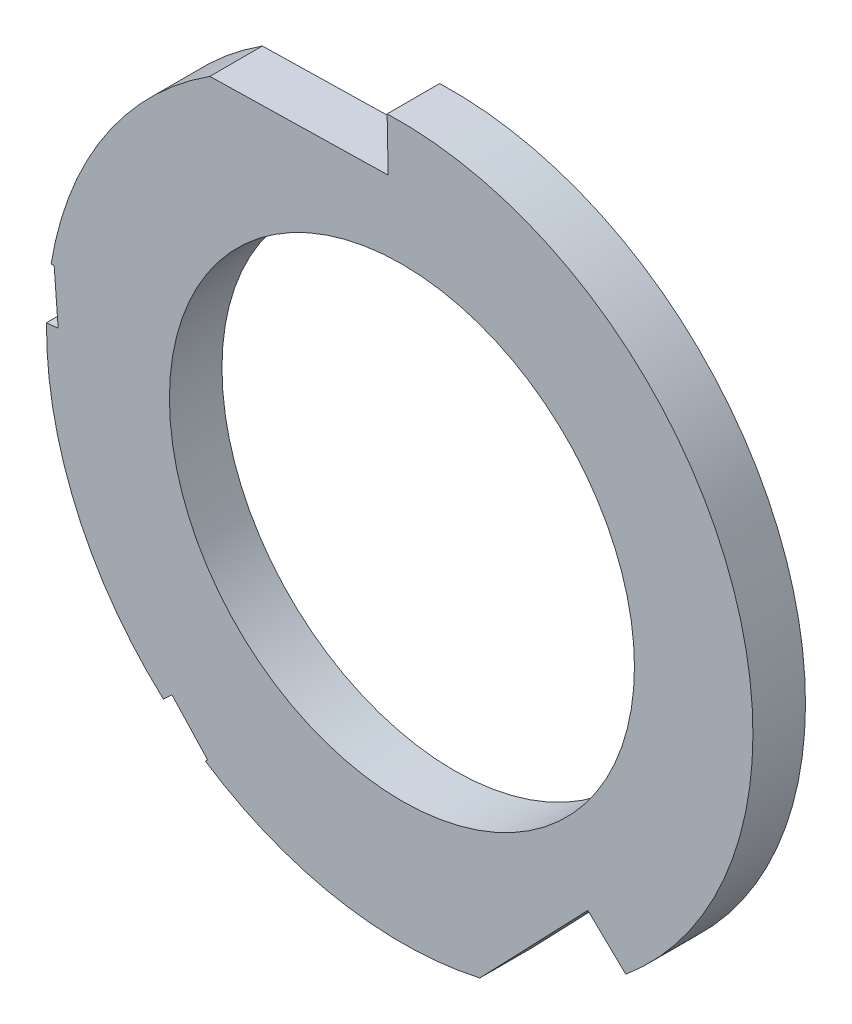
from build123d import *

# Parameters (mm, degrees)
SKETCH1_R           = 6.7437
BOSS_EXTRUDE1_DEPTH = 1.524


with BuildPart() as part:
    # Sketch1 → Boss-Extrude1 (new body)
    with BuildSketch(Plane.XY):
        with BuildLine():
            Line((9.038930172, 5.397352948), (9.069912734, 3.873667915))
            Line((9.069912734, 3.873667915), (3.896628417, 3.768474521))
            ThreePointArc((3.896628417, 3.768474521), (0.84852896, 0.749318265), (-0.706647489, -3.249136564))
            Line((-0.706647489, -3.249136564), (-0.618556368, -3.242322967))
            Line((-0.618556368, -3.242322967), (-0.501030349, -4.761784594))
            Line((-0.501030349, -4.761784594), (-0.83984188, -4.787990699))
            ThreePointArc((-0.83984188, -4.787990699), (0.021484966, -9.03170755), (2.549623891, -12.547319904))
            Line((2.549623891, -12.547319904), (2.799079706, -12.316556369))
            Line((2.799079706, -12.316556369), (3.833980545, -13.435286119))
            Line((3.833980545, -13.435286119), (3.769121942, -13.495284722))
            ThreePointArc((3.769121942, -13.495284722), (7.598553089, -15.043003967), (11.728156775, -14.96330978))
            Line((11.728156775, -14.96330978), (14.861408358, -11.697546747))
            Line((14.861408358, -11.697546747), (15.961119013, -12.752635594))
            ThreePointArc((15.961119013, -12.752635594), (18.974662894, -1.20829161), (9.038930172, 5.397352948))
        make_face()
        with Locations(Location((9.468478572, -4.905028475, 0), (0, 0, 180))):
            Circle(SKETCH1_R, mode=Mode.SUBTRACT)
    extrude(amount=BOSS_EXTRUDE1_DEPTH)


solid = part.part
